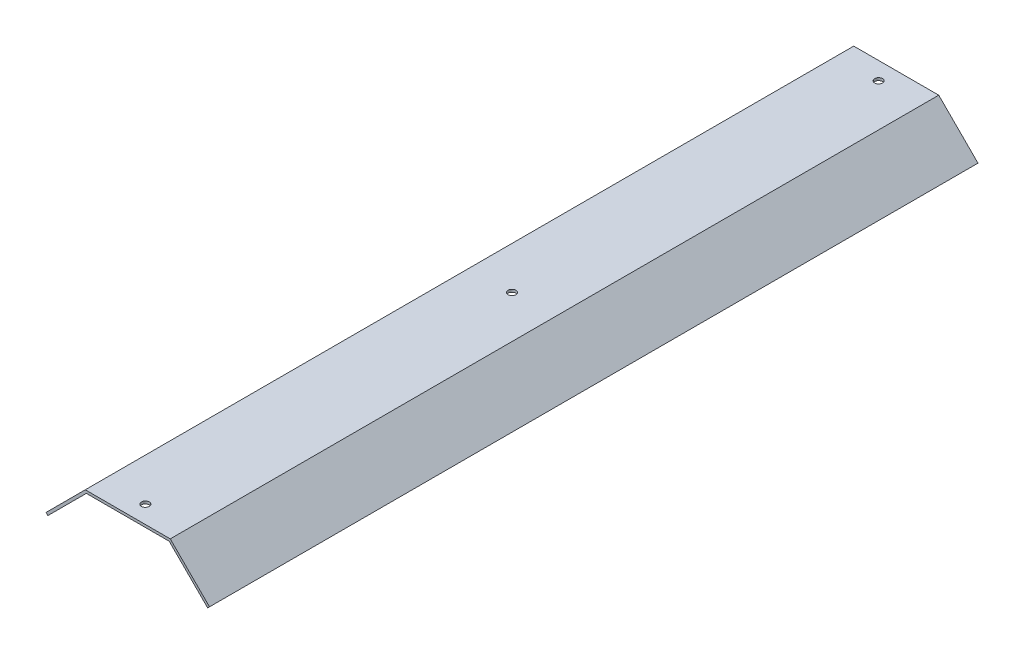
ISO-10303-21;
HEADER;
FILE_DESCRIPTION(('STEP AP214'),'2;1');
FILE_NAME('part.step','',(''),(''),'','','');
FILE_SCHEMA(('AUTOMOTIVE_DESIGN { 1 0 10303 214 1 1 1 1 }'));
ENDSEC;
DATA;
#1=APPLICATION_CONTEXT('core data for automotive mechanical design processes');
#2=APPLICATION_PROTOCOL_DEFINITION('international standard','automotive_design',2000,#1);
#3=PRODUCT_CONTEXT('',#1,'mechanical');
#4=PRODUCT('Part','Part','',(#3));
#5=PRODUCT_RELATED_PRODUCT_CATEGORY('part','',(#4));
#6=PRODUCT_DEFINITION_FORMATION('','',#4);
#7=PRODUCT_DEFINITION_CONTEXT('part definition',#1,'design');
#8=PRODUCT_DEFINITION('design','',#6,#7);
#9=PRODUCT_DEFINITION_SHAPE('','',#8);
#10=(LENGTH_UNIT() NAMED_UNIT(*) SI_UNIT(.MILLI.,.METRE.));
#11=(NAMED_UNIT(*) PLANE_ANGLE_UNIT() SI_UNIT($,.RADIAN.));
#12=(NAMED_UNIT(*) SI_UNIT($,.STERADIAN.) SOLID_ANGLE_UNIT());
#13=UNCERTAINTY_MEASURE_WITH_UNIT(LENGTH_MEASURE(1.E-05),#10,'distance_accuracy_value','');
#14=(GEOMETRIC_REPRESENTATION_CONTEXT(3) GLOBAL_UNCERTAINTY_ASSIGNED_CONTEXT((#13)) GLOBAL_UNIT_ASSIGNED_CONTEXT((#10,
#11,#12)) REPRESENTATION_CONTEXT('',''));
#15=CARTESIAN_POINT('',(0.,0.,0.));
#16=DIRECTION('',(0.,0.,1.));
#17=DIRECTION('',(1.,0.,0.));
#18=AXIS2_PLACEMENT_3D('',#15,#16,#17);
#19=CARTESIAN_POINT('',(47.1274169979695,-5.12741699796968,443.));
#20=DIRECTION('',(-0.70710678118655,-0.707106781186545,0.));
#21=DIRECTION('',(0.707106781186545,-0.70710678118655,0.));
#22=AXIS2_PLACEMENT_3D('',#19,#20,#21);
#23=PLANE('',#22);
#24=DIRECTION('',(-0.707106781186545,0.70710678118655,0.));
#25=VECTOR('',#24,1.);
#26=CARTESIAN_POINT('',(47.1274169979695,-5.12741699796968,0.));
#27=LINE('',#26,#25);
#28=CARTESIAN_POINT('',(47.1274169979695,-5.12741699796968,0.));
#29=VERTEX_POINT('',#28);
#30=CARTESIAN_POINT('',(24.5,17.4999999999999,0.));
#31=VERTEX_POINT('',#30);
#32=EDGE_CURVE('E132',#29,#31,#27,.T.);
#33=ORIENTED_EDGE('',*,*,#32,.T.);
#34=DIRECTION('',(0.,0.,-1.));
#35=VECTOR('',#34,1.);
#36=CARTESIAN_POINT('',(24.5,17.4999999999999,443.));
#37=LINE('',#36,#35);
#38=CARTESIAN_POINT('',(24.5,17.4999999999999,443.));
#39=VERTEX_POINT('',#38);
#40=EDGE_CURVE('E11',#39,#31,#37,.T.);
#41=ORIENTED_EDGE('',*,*,#40,.F.);
#42=DIRECTION('',(-0.707106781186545,0.70710678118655,0.));
#43=VECTOR('',#42,1.);
#44=CARTESIAN_POINT('',(47.1274169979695,-5.12741699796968,443.));
#45=LINE('',#44,#43);
#46=CARTESIAN_POINT('',(47.1274169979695,-5.12741699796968,443.));
#47=VERTEX_POINT('',#46);
#48=EDGE_CURVE('E146',#47,#39,#45,.T.);
#49=ORIENTED_EDGE('',*,*,#48,.F.);
#50=DIRECTION('',(0.,0.,-1.));
#51=VECTOR('',#50,1.);
#52=CARTESIAN_POINT('',(47.1274169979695,-5.12741699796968,443.));
#53=LINE('',#52,#51);
#54=EDGE_CURVE('E128',#47,#29,#53,.T.);
#55=ORIENTED_EDGE('',*,*,#54,.T.);
#56=EDGE_LOOP('',(#33,#41,#49,#55));
#57=FACE_BOUND('',#56,.T.);
#58=ADVANCED_FACE('F34',(#57),#23,.F.);
#59=CARTESIAN_POINT('',(24.5,17.4999999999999,443.));
#60=DIRECTION('',(0.,-1.,0.));
#61=DIRECTION('',(1.,0.,0.));
#62=AXIS2_PLACEMENT_3D('',#59,#60,#61);
#63=PLANE('',#62);
#64=CARTESIAN_POINT('',(0.,17.5,10.15));
#65=DIRECTION('',(0.,1.,0.));
#66=DIRECTION('',(-1.,0.,0.));
#67=AXIS2_PLACEMENT_3D('',#64,#65,#66);
#68=CIRCLE('',#67,2.25);
#69=CARTESIAN_POINT('',(-2.24999999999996,17.5,10.15));
#70=VERTEX_POINT('',#69);
#71=EDGE_CURVE('E161',#70,#70,#68,.T.);
#72=ORIENTED_EDGE('',*,*,#71,.F.);
#73=EDGE_LOOP('',(#72));
#74=FACE_BOUND('',#73,.T.);
#75=CARTESIAN_POINT('',(0.,17.5,221.5));
#76=DIRECTION('',(0.,1.,0.));
#77=DIRECTION('',(-1.,0.,0.));
#78=AXIS2_PLACEMENT_3D('',#75,#76,#77);
#79=CIRCLE('',#78,2.25);
#80=CARTESIAN_POINT('',(-2.24999999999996,17.5,221.5));
#81=VERTEX_POINT('',#80);
#82=EDGE_CURVE('E210',#81,#81,#79,.T.);
#83=ORIENTED_EDGE('',*,*,#82,.F.);
#84=EDGE_LOOP('',(#83));
#85=FACE_BOUND('',#84,.T.);
#86=CARTESIAN_POINT('',(0.,17.5,432.85));
#87=DIRECTION('',(0.,1.,0.));
#88=DIRECTION('',(-1.,0.,0.));
#89=AXIS2_PLACEMENT_3D('',#86,#87,#88);
#90=CIRCLE('',#89,2.25);
#91=CARTESIAN_POINT('',(-2.24999999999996,17.5,432.85));
#92=VERTEX_POINT('',#91);
#93=EDGE_CURVE('E207',#92,#92,#90,.T.);
#94=ORIENTED_EDGE('',*,*,#93,.F.);
#95=EDGE_LOOP('',(#94));
#96=FACE_BOUND('',#95,.T.);
#97=DIRECTION('',(-1.,0.,0.));
#98=VECTOR('',#97,1.);
#99=CARTESIAN_POINT('',(24.5,17.4999999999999,0.));
#100=LINE('',#99,#98);
#101=CARTESIAN_POINT('',(-24.5,17.5,0.));
#102=VERTEX_POINT('',#101);
#103=EDGE_CURVE('E135',#31,#102,#100,.T.);
#104=ORIENTED_EDGE('',*,*,#103,.T.);
#105=DIRECTION('',(0.,0.,-1.));
#106=VECTOR('',#105,1.);
#107=CARTESIAN_POINT('',(-24.5,17.5,443.));
#108=LINE('',#107,#106);
#109=CARTESIAN_POINT('',(-24.5,17.5,443.));
#110=VERTEX_POINT('',#109);
#111=EDGE_CURVE('E43',#110,#102,#108,.T.);
#112=ORIENTED_EDGE('',*,*,#111,.F.);
#113=DIRECTION('',(-1.,0.,0.));
#114=VECTOR('',#113,1.);
#115=CARTESIAN_POINT('',(24.5,17.4999999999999,443.));
#116=LINE('',#115,#114);
#117=EDGE_CURVE('E95',#39,#110,#116,.T.);
#118=ORIENTED_EDGE('',*,*,#117,.F.);
#119=ORIENTED_EDGE('',*,*,#40,.T.);
#120=EDGE_LOOP('',(#104,#112,#118,#119));
#121=FACE_BOUND('',#120,.T.);
#122=ADVANCED_FACE('F182',(#74,#85,#96,#121),#63,.F.);
#123=CARTESIAN_POINT('',(-24.5,17.5,443.));
#124=DIRECTION('',(0.707106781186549,-0.707106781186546,0.));
#125=DIRECTION('',(0.707106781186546,0.707106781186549,0.));
#126=AXIS2_PLACEMENT_3D('',#123,#124,#125);
#127=PLANE('',#126);
#128=DIRECTION('',(-0.707106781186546,-0.707106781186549,0.));
#129=VECTOR('',#128,1.);
#130=CARTESIAN_POINT('',(-24.5,17.5,0.));
#131=LINE('',#130,#129);
#132=CARTESIAN_POINT('',(-47.1274169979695,-5.12741699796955,0.));
#133=VERTEX_POINT('',#132);
#134=EDGE_CURVE('E137',#102,#133,#131,.T.);
#135=ORIENTED_EDGE('',*,*,#134,.T.);
#136=DIRECTION('',(0.,0.,-1.));
#137=VECTOR('',#136,1.);
#138=CARTESIAN_POINT('',(-47.1274169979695,-5.12741699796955,443.));
#139=LINE('',#138,#137);
#140=CARTESIAN_POINT('',(-47.1274169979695,-5.12741699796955,443.));
#141=VERTEX_POINT('',#140);
#142=EDGE_CURVE('E153',#141,#133,#139,.T.);
#143=ORIENTED_EDGE('',*,*,#142,.F.);
#144=DIRECTION('',(-0.707106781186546,-0.707106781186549,0.));
#145=VECTOR('',#144,1.);
#146=CARTESIAN_POINT('',(-24.5,17.5,443.));
#147=LINE('',#146,#145);
#148=EDGE_CURVE('E199',#110,#141,#147,.T.);
#149=ORIENTED_EDGE('',*,*,#148,.F.);
#150=ORIENTED_EDGE('',*,*,#111,.T.);
#151=EDGE_LOOP('',(#135,#143,#149,#150));
#152=FACE_BOUND('',#151,.T.);
#153=ADVANCED_FACE('F187',(#152),#127,.F.);
#154=CARTESIAN_POINT('',(-47.1274169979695,-5.12741699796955,443.));
#155=DIRECTION('',(0.70710678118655,0.707106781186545,0.));
#156=DIRECTION('',(-0.707106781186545,0.70710678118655,0.));
#157=AXIS2_PLACEMENT_3D('',#154,#155,#156);
#158=PLANE('',#157);
#159=DIRECTION('',(0.707106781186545,-0.70710678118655,0.));
#160=VECTOR('',#159,1.);
#161=CARTESIAN_POINT('',(-47.1274169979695,-5.12741699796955,0.));
#162=LINE('',#161,#160);
#163=CARTESIAN_POINT('',(-46.0667568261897,-6.18807716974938,0.));
#164=VERTEX_POINT('',#163);
#165=EDGE_CURVE('E139',#133,#164,#162,.T.);
#166=ORIENTED_EDGE('',*,*,#165,.T.);
#167=DIRECTION('',(0.,0.,-1.));
#168=VECTOR('',#167,1.);
#169=CARTESIAN_POINT('',(-46.0667568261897,-6.18807716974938,443.));
#170=LINE('',#169,#168);
#171=CARTESIAN_POINT('',(-46.0667568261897,-6.18807716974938,443.));
#172=VERTEX_POINT('',#171);
#173=EDGE_CURVE('E150',#172,#164,#170,.T.);
#174=ORIENTED_EDGE('',*,*,#173,.F.);
#175=DIRECTION('',(0.707106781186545,-0.70710678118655,0.));
#176=VECTOR('',#175,1.);
#177=CARTESIAN_POINT('',(-47.1274169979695,-5.12741699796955,443.));
#178=LINE('',#177,#176);
#179=EDGE_CURVE('E201',#141,#172,#178,.T.);
#180=ORIENTED_EDGE('',*,*,#179,.F.);
#181=ORIENTED_EDGE('',*,*,#142,.T.);
#182=EDGE_LOOP('',(#166,#174,#180,#181));
#183=FACE_BOUND('',#182,.T.);
#184=ADVANCED_FACE('F233',(#183),#158,.F.);
#185=CARTESIAN_POINT('',(-46.0667568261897,-6.18807716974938,443.));
#186=DIRECTION('',(-0.707106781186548,0.707106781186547,0.));
#187=DIRECTION('',(-0.707106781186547,-0.707106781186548,0.));
#188=AXIS2_PLACEMENT_3D('',#185,#186,#187);
#189=PLANE('',#188);
#190=DIRECTION('',(0.707106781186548,0.707106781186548,0.));
#191=VECTOR('',#190,1.);
#192=CARTESIAN_POINT('',(-46.0667568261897,-6.18807716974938,0.));
#193=LINE('',#192,#191);
#194=CARTESIAN_POINT('',(-23.8786796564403,16.,0.));
#195=VERTEX_POINT('',#194);
#196=EDGE_CURVE('E141',#164,#195,#193,.T.);
#197=ORIENTED_EDGE('',*,*,#196,.T.);
#198=DIRECTION('',(0.,0.,-1.));
#199=VECTOR('',#198,1.);
#200=CARTESIAN_POINT('',(-23.8786796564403,16.,443.));
#201=LINE('',#200,#199);
#202=CARTESIAN_POINT('',(-23.8786796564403,16.,443.));
#203=VERTEX_POINT('',#202);
#204=EDGE_CURVE('E123',#203,#195,#201,.T.);
#205=ORIENTED_EDGE('',*,*,#204,.F.);
#206=DIRECTION('',(0.707106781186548,0.707106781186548,0.));
#207=VECTOR('',#206,1.);
#208=CARTESIAN_POINT('',(-46.0667568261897,-6.18807716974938,443.));
#209=LINE('',#208,#207);
#210=EDGE_CURVE('E114',#172,#203,#209,.T.);
#211=ORIENTED_EDGE('',*,*,#210,.F.);
#212=ORIENTED_EDGE('',*,*,#173,.T.);
#213=EDGE_LOOP('',(#197,#205,#211,#212));
#214=FACE_BOUND('',#213,.T.);
#215=ADVANCED_FACE('F225',(#214),#189,.F.);
#216=CARTESIAN_POINT('',(-23.8786796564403,16.,443.));
#217=DIRECTION('',(0.,1.,0.));
#218=DIRECTION('',(-1.,0.,0.));
#219=AXIS2_PLACEMENT_3D('',#216,#217,#218);
#220=PLANE('',#219);
#221=CARTESIAN_POINT('',(0.,16.,10.15));
#222=DIRECTION('',(0.,1.,0.));
#223=DIRECTION('',(-1.,0.,0.));
#224=AXIS2_PLACEMENT_3D('',#221,#222,#223);
#225=CIRCLE('',#224,2.25);
#226=CARTESIAN_POINT('',(-2.24999999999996,16.,10.15));
#227=VERTEX_POINT('',#226);
#228=EDGE_CURVE('E37',#227,#227,#225,.T.);
#229=ORIENTED_EDGE('',*,*,#228,.T.);
#230=EDGE_LOOP('',(#229));
#231=FACE_BOUND('',#230,.T.);
#232=CARTESIAN_POINT('',(0.,16.,221.5));
#233=DIRECTION('',(0.,1.,0.));
#234=DIRECTION('',(-1.,0.,0.));
#235=AXIS2_PLACEMENT_3D('',#232,#233,#234);
#236=CIRCLE('',#235,2.25);
#237=CARTESIAN_POINT('',(-2.24999999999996,16.,221.5));
#238=VERTEX_POINT('',#237);
#239=EDGE_CURVE('E160',#238,#238,#236,.T.);
#240=ORIENTED_EDGE('',*,*,#239,.T.);
#241=EDGE_LOOP('',(#240));
#242=FACE_BOUND('',#241,.T.);
#243=CARTESIAN_POINT('',(0.,16.,432.85));
#244=DIRECTION('',(0.,1.,0.));
#245=DIRECTION('',(-1.,0.,0.));
#246=AXIS2_PLACEMENT_3D('',#243,#244,#245);
#247=CIRCLE('',#246,2.25);
#248=CARTESIAN_POINT('',(-2.24999999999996,16.,432.85));
#249=VERTEX_POINT('',#248);
#250=EDGE_CURVE('E158',#249,#249,#247,.T.);
#251=ORIENTED_EDGE('',*,*,#250,.T.);
#252=EDGE_LOOP('',(#251));
#253=FACE_BOUND('',#252,.T.);
#254=DIRECTION('',(1.,0.,0.));
#255=VECTOR('',#254,1.);
#256=CARTESIAN_POINT('',(-23.8786796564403,16.,0.));
#257=LINE('',#256,#255);
#258=CARTESIAN_POINT('',(23.8786796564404,16.,0.));
#259=VERTEX_POINT('',#258);
#260=EDGE_CURVE('E122',#195,#259,#257,.T.);
#261=ORIENTED_EDGE('',*,*,#260,.T.);
#262=DIRECTION('',(0.,0.,-1.));
#263=VECTOR('',#262,1.);
#264=CARTESIAN_POINT('',(23.8786796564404,16.,443.));
#265=LINE('',#264,#263);
#266=CARTESIAN_POINT('',(23.8786796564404,16.,443.));
#267=VERTEX_POINT('',#266);
#268=EDGE_CURVE('E119',#267,#259,#265,.T.);
#269=ORIENTED_EDGE('',*,*,#268,.F.);
#270=DIRECTION('',(1.,0.,0.));
#271=VECTOR('',#270,1.);
#272=CARTESIAN_POINT('',(-23.8786796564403,16.,443.));
#273=LINE('',#272,#271);
#274=EDGE_CURVE('E108',#203,#267,#273,.T.);
#275=ORIENTED_EDGE('',*,*,#274,.F.);
#276=ORIENTED_EDGE('',*,*,#204,.T.);
#277=EDGE_LOOP('',(#261,#269,#275,#276));
#278=FACE_BOUND('',#277,.T.);
#279=ADVANCED_FACE('F120',(#231,#242,#253,#278),#220,.F.);
#280=CARTESIAN_POINT('',(23.8786796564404,16.,443.));
#281=DIRECTION('',(0.707106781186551,0.707106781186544,0.));
#282=DIRECTION('',(-0.707106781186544,0.707106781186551,0.));
#283=AXIS2_PLACEMENT_3D('',#280,#281,#282);
#284=PLANE('',#283);
#285=DIRECTION('',(0.707106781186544,-0.707106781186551,0.));
#286=VECTOR('',#285,1.);
#287=CARTESIAN_POINT('',(23.8786796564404,16.,0.));
#288=LINE('',#287,#286);
#289=CARTESIAN_POINT('',(46.0667568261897,-6.18807716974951,0.));
#290=VERTEX_POINT('',#289);
#291=EDGE_CURVE('E81',#259,#290,#288,.T.);
#292=ORIENTED_EDGE('',*,*,#291,.T.);
#293=DIRECTION('',(0.,0.,-1.));
#294=VECTOR('',#293,1.);
#295=CARTESIAN_POINT('',(46.0667568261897,-6.18807716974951,443.));
#296=LINE('',#295,#294);
#297=CARTESIAN_POINT('',(46.0667568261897,-6.18807716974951,443.));
#298=VERTEX_POINT('',#297);
#299=EDGE_CURVE('E124',#298,#290,#296,.T.);
#300=ORIENTED_EDGE('',*,*,#299,.F.);
#301=DIRECTION('',(0.707106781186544,-0.707106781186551,0.));
#302=VECTOR('',#301,1.);
#303=CARTESIAN_POINT('',(23.8786796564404,16.,443.));
#304=LINE('',#303,#302);
#305=EDGE_CURVE('E112',#267,#298,#304,.T.);
#306=ORIENTED_EDGE('',*,*,#305,.F.);
#307=ORIENTED_EDGE('',*,*,#268,.T.);
#308=EDGE_LOOP('',(#292,#300,#306,#307));
#309=FACE_BOUND('',#308,.T.);
#310=ADVANCED_FACE('F126',(#309),#284,.F.);
#311=CARTESIAN_POINT('',(46.0667568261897,-6.18807716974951,443.));
#312=DIRECTION('',(-0.707106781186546,0.707106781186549,0.));
#313=DIRECTION('',(-0.707106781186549,-0.707106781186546,0.));
#314=AXIS2_PLACEMENT_3D('',#311,#312,#313);
#315=PLANE('',#314);
#316=DIRECTION('',(0.707106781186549,0.707106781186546,0.));
#317=VECTOR('',#316,1.);
#318=CARTESIAN_POINT('',(46.0667568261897,-6.18807716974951,0.));
#319=LINE('',#318,#317);
#320=EDGE_CURVE('E87',#290,#29,#319,.T.);
#321=ORIENTED_EDGE('',*,*,#320,.T.);
#322=ORIENTED_EDGE('',*,*,#54,.F.);
#323=DIRECTION('',(0.707106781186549,0.707106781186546,0.));
#324=VECTOR('',#323,1.);
#325=CARTESIAN_POINT('',(46.0667568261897,-6.18807716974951,443.));
#326=LINE('',#325,#324);
#327=EDGE_CURVE('E52',#298,#47,#326,.T.);
#328=ORIENTED_EDGE('',*,*,#327,.F.);
#329=ORIENTED_EDGE('',*,*,#299,.T.);
#330=EDGE_LOOP('',(#321,#322,#328,#329));
#331=FACE_BOUND('',#330,.T.);
#332=ADVANCED_FACE('F231',(#331),#315,.F.);
#333=CARTESIAN_POINT('',(0.,0.,443.));
#334=DIRECTION('',(0.,0.,1.));
#335=DIRECTION('',(1.,0.,0.));
#336=AXIS2_PLACEMENT_3D('',#333,#334,#335);
#337=PLANE('',#336);
#338=ORIENTED_EDGE('',*,*,#48,.T.);
#339=ORIENTED_EDGE('',*,*,#117,.T.);
#340=ORIENTED_EDGE('',*,*,#148,.T.);
#341=ORIENTED_EDGE('',*,*,#179,.T.);
#342=ORIENTED_EDGE('',*,*,#210,.T.);
#343=ORIENTED_EDGE('',*,*,#274,.T.);
#344=ORIENTED_EDGE('',*,*,#305,.T.);
#345=ORIENTED_EDGE('',*,*,#327,.T.);
#346=EDGE_LOOP('',(#338,#339,#340,#341,#342,#343,#344,#345));
#347=FACE_BOUND('',#346,.T.);
#348=ADVANCED_FACE('F110',(#347),#337,.T.);
#349=CARTESIAN_POINT('',(0.,0.,0.));
#350=DIRECTION('',(0.,0.,1.));
#351=DIRECTION('',(1.,0.,0.));
#352=AXIS2_PLACEMENT_3D('',#349,#350,#351);
#353=PLANE('',#352);
#354=ORIENTED_EDGE('',*,*,#32,.F.);
#355=ORIENTED_EDGE('',*,*,#320,.F.);
#356=ORIENTED_EDGE('',*,*,#291,.F.);
#357=ORIENTED_EDGE('',*,*,#260,.F.);
#358=ORIENTED_EDGE('',*,*,#196,.F.);
#359=ORIENTED_EDGE('',*,*,#165,.F.);
#360=ORIENTED_EDGE('',*,*,#134,.F.);
#361=ORIENTED_EDGE('',*,*,#103,.F.);
#362=EDGE_LOOP('',(#354,#355,#356,#357,#358,#359,#360,#361));
#363=FACE_BOUND('',#362,.T.);
#364=ADVANCED_FACE('F193',(#363),#353,.F.);
#365=CARTESIAN_POINT('',(0.,7.49999999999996,432.85));
#366=DIRECTION('',(0.,1.,0.));
#367=DIRECTION('',(-1.,0.,0.));
#368=AXIS2_PLACEMENT_3D('',#365,#366,#367);
#369=CYLINDRICAL_SURFACE('',#368,2.25);
#370=ORIENTED_EDGE('',*,*,#93,.T.);
#371=EDGE_LOOP('',(#370));
#372=FACE_BOUND('',#371,.T.);
#373=ORIENTED_EDGE('',*,*,#250,.F.);
#374=EDGE_LOOP('',(#373));
#375=FACE_BOUND('',#374,.T.);
#376=ADVANCED_FACE('F177',(#372,#375),#369,.F.);
#377=CARTESIAN_POINT('',(0.,7.49999999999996,221.5));
#378=DIRECTION('',(0.,1.,0.));
#379=DIRECTION('',(-1.,0.,0.));
#380=AXIS2_PLACEMENT_3D('',#377,#378,#379);
#381=CYLINDRICAL_SURFACE('',#380,2.25);
#382=ORIENTED_EDGE('',*,*,#82,.T.);
#383=EDGE_LOOP('',(#382));
#384=FACE_BOUND('',#383,.T.);
#385=ORIENTED_EDGE('',*,*,#239,.F.);
#386=EDGE_LOOP('',(#385));
#387=FACE_BOUND('',#386,.T.);
#388=ADVANCED_FACE('F171',(#384,#387),#381,.F.);
#389=CARTESIAN_POINT('',(0.,7.49999999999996,10.15));
#390=DIRECTION('',(0.,1.,0.));
#391=DIRECTION('',(-1.,0.,0.));
#392=AXIS2_PLACEMENT_3D('',#389,#390,#391);
#393=CYLINDRICAL_SURFACE('',#392,2.25);
#394=ORIENTED_EDGE('',*,*,#71,.T.);
#395=EDGE_LOOP('',(#394));
#396=FACE_BOUND('',#395,.T.);
#397=ORIENTED_EDGE('',*,*,#228,.F.);
#398=EDGE_LOOP('',(#397));
#399=FACE_BOUND('',#398,.T.);
#400=ADVANCED_FACE('F169',(#396,#399),#393,.F.);
#401=CLOSED_SHELL('',(#58,#122,#153,#184,#215,#279,#310,#332,#348,#364,#376,#388,#400));
#402=MANIFOLD_SOLID_BREP('B2',#401);
#403=ADVANCED_BREP_SHAPE_REPRESENTATION('',(#18,#402),#14);
#404=SHAPE_DEFINITION_REPRESENTATION(#9,#403);
ENDSEC;
END-ISO-10303-21;
